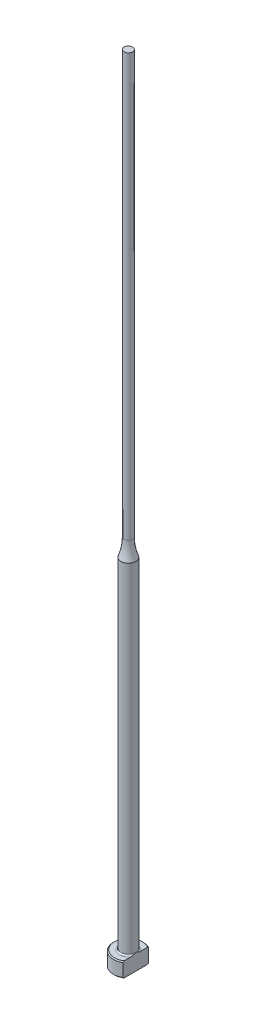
ISO-10303-21;
HEADER;
FILE_DESCRIPTION(('STEP AP214'),'2;1');
FILE_NAME('part.step','',(''),(''),'','','');
FILE_SCHEMA(('AUTOMOTIVE_DESIGN { 1 0 10303 214 1 1 1 1 }'));
ENDSEC;
DATA;
#1=APPLICATION_CONTEXT('core data for automotive mechanical design processes');
#2=APPLICATION_PROTOCOL_DEFINITION('international standard','automotive_design',2000,#1);
#3=PRODUCT_CONTEXT('',#1,'mechanical');
#4=PRODUCT('Part','Part','',(#3));
#5=PRODUCT_RELATED_PRODUCT_CATEGORY('part','',(#4));
#6=PRODUCT_DEFINITION_FORMATION('','',#4);
#7=PRODUCT_DEFINITION_CONTEXT('part definition',#1,'design');
#8=PRODUCT_DEFINITION('design','',#6,#7);
#9=PRODUCT_DEFINITION_SHAPE('','',#8);
#10=(LENGTH_UNIT() NAMED_UNIT(*) SI_UNIT(.MILLI.,.METRE.));
#11=(NAMED_UNIT(*) PLANE_ANGLE_UNIT() SI_UNIT($,.RADIAN.));
#12=(NAMED_UNIT(*) SI_UNIT($,.STERADIAN.) SOLID_ANGLE_UNIT());
#13=UNCERTAINTY_MEASURE_WITH_UNIT(LENGTH_MEASURE(1.E-05),#10,'distance_accuracy_value','');
#14=(GEOMETRIC_REPRESENTATION_CONTEXT(3) GLOBAL_UNCERTAINTY_ASSIGNED_CONTEXT((#13)) GLOBAL_UNIT_ASSIGNED_CONTEXT((#10,
#11,#12)) REPRESENTATION_CONTEXT('',''));
#15=CARTESIAN_POINT('',(0.,0.,0.));
#16=DIRECTION('',(0.,0.,1.));
#17=DIRECTION('',(1.,0.,0.));
#18=AXIS2_PLACEMENT_3D('',#15,#16,#17);
#19=CARTESIAN_POINT('',(-2.99999999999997,3.,0.));
#20=DIRECTION('',(0.,1.,0.));
#21=DIRECTION('',(0.,0.,1.));
#22=AXIS2_PLACEMENT_3D('',#19,#20,#21);
#23=PLANE('',#22);
#24=CARTESIAN_POINT('',(0.,3.,0.));
#25=DIRECTION('',(0.,1.,0.));
#26=DIRECTION('',(0.,0.,1.));
#27=AXIS2_PLACEMENT_3D('',#24,#25,#26);
#28=CIRCLE('',#27,2.79999999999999);
#29=CARTESIAN_POINT('',(1.49999999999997,3.,-2.36431808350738));
#30=VERTEX_POINT('',#29);
#31=CARTESIAN_POINT('',(1.49999999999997,3.,2.36431808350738));
#32=VERTEX_POINT('',#31);
#33=EDGE_CURVE('E187',#30,#32,#28,.T.);
#34=ORIENTED_EDGE('',*,*,#33,.T.);
#35=DIRECTION('',(0.,0.,-1.));
#36=VECTOR('',#35,1.);
#37=CARTESIAN_POINT('',(1.49999999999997,3.,0.));
#38=LINE('',#37,#36);
#39=CARTESIAN_POINT('',(1.49999999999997,3.00000000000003,0.99498743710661));
#40=VERTEX_POINT('',#39);
#41=EDGE_CURVE('E57',#32,#40,#38,.T.);
#42=ORIENTED_EDGE('',*,*,#41,.T.);
#43=CARTESIAN_POINT('',(0.,3.,0.));
#44=DIRECTION('',(0.,1.,0.));
#45=DIRECTION('',(0.,0.,1.));
#46=AXIS2_PLACEMENT_3D('',#43,#44,#45);
#47=CIRCLE('',#46,1.79999999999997);
#48=CARTESIAN_POINT('',(1.49999999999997,3.00000000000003,-0.994987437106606));
#49=VERTEX_POINT('',#48);
#50=EDGE_CURVE('E108',#40,#49,#47,.F.);
#51=ORIENTED_EDGE('',*,*,#50,.T.);
#52=EDGE_CURVE('E137',#49,#30,#38,.T.);
#53=ORIENTED_EDGE('',*,*,#52,.T.);
#54=EDGE_LOOP('',(#34,#42,#51,#53));
#55=FACE_BOUND('',#54,.T.);
#56=ADVANCED_FACE('F32',(#55),#23,.T.);
#57=CARTESIAN_POINT('',(0.,259.958771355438,0.));
#58=DIRECTION('',(0.,1.,0.));
#59=DIRECTION('',(0.,0.,1.));
#60=AXIS2_PLACEMENT_3D('',#57,#58,#59);
#61=CYLINDRICAL_SURFACE('',#60,2.99999999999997);
#62=CARTESIAN_POINT('',(0.,2.80000000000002,0.));
#63=DIRECTION('',(0.,1.,0.));
#64=DIRECTION('',(0.,0.,1.));
#65=AXIS2_PLACEMENT_3D('',#62,#63,#64);
#66=CIRCLE('',#65,2.99999999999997);
#67=CARTESIAN_POINT('',(1.49999999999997,2.80000000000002,2.5980762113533));
#68=VERTEX_POINT('',#67);
#69=CARTESIAN_POINT('',(1.49999999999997,2.80000000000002,-2.5980762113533));
#70=VERTEX_POINT('',#69);
#71=EDGE_CURVE('E105',#68,#70,#66,.F.);
#72=ORIENTED_EDGE('',*,*,#71,.T.);
#73=DIRECTION('',(0.,-1.,0.));
#74=VECTOR('',#73,1.);
#75=CARTESIAN_POINT('',(1.49999999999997,160.,-2.5980762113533));
#76=LINE('',#75,#74);
#77=CARTESIAN_POINT('',(1.49999999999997,0.200000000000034,-2.5980762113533));
#78=VERTEX_POINT('',#77);
#79=EDGE_CURVE('E193',#70,#78,#76,.T.);
#80=ORIENTED_EDGE('',*,*,#79,.T.);
#81=CARTESIAN_POINT('',(0.,0.200000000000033,0.));
#82=DIRECTION('',(0.,-1.,0.));
#83=DIRECTION('',(0.,0.,-1.));
#84=AXIS2_PLACEMENT_3D('',#81,#82,#83);
#85=CIRCLE('',#84,2.99999999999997);
#86=CARTESIAN_POINT('',(1.49999999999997,0.200000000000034,2.5980762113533));
#87=VERTEX_POINT('',#86);
#88=EDGE_CURVE('E100',#78,#87,#85,.F.);
#89=ORIENTED_EDGE('',*,*,#88,.T.);
#90=DIRECTION('',(0.,-1.,0.));
#91=VECTOR('',#90,1.);
#92=CARTESIAN_POINT('',(1.49999999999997,160.,2.5980762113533));
#93=LINE('',#92,#91);
#94=EDGE_CURVE('E93',#68,#87,#93,.T.);
#95=ORIENTED_EDGE('',*,*,#94,.F.);
#96=EDGE_LOOP('',(#72,#80,#89,#95));
#97=FACE_BOUND('',#96,.T.);
#98=ADVANCED_FACE('F158',(#97),#61,.T.);
#99=CARTESIAN_POINT('',(0.,0.,0.));
#100=DIRECTION('',(0.,-1.,0.));
#101=DIRECTION('',(0.,0.,-1.));
#102=AXIS2_PLACEMENT_3D('',#99,#100,#101);
#103=PLANE('',#102);
#104=CARTESIAN_POINT('',(0.,0.,0.));
#105=DIRECTION('',(0.,-1.,0.));
#106=DIRECTION('',(0.,0.,-1.));
#107=AXIS2_PLACEMENT_3D('',#104,#105,#106);
#108=CIRCLE('',#107,2.79999999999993);
#109=CARTESIAN_POINT('',(1.49999999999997,0.,2.36431808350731));
#110=VERTEX_POINT('',#109);
#111=CARTESIAN_POINT('',(1.49999999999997,0.,-2.36431808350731));
#112=VERTEX_POINT('',#111);
#113=EDGE_CURVE('E98',#110,#112,#108,.T.);
#114=ORIENTED_EDGE('',*,*,#113,.T.);
#115=DIRECTION('',(0.,0.,1.));
#116=VECTOR('',#115,1.);
#117=CARTESIAN_POINT('',(1.49999999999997,0.,-2.5980762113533));
#118=LINE('',#117,#116);
#119=EDGE_CURVE('E83',#112,#110,#118,.T.);
#120=ORIENTED_EDGE('',*,*,#119,.T.);
#121=EDGE_LOOP('',(#114,#120));
#122=FACE_BOUND('',#121,.T.);
#123=ADVANCED_FACE('F103',(#122),#103,.T.);
#124=CARTESIAN_POINT('',(0.,3.,0.));
#125=DIRECTION('',(0.,-1.,0.));
#126=DIRECTION('',(0.,0.,-1.));
#127=AXIS2_PLACEMENT_3D('',#124,#125,#126);
#128=CONICAL_SURFACE('',#127,2.79999999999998,0.785398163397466);
#129=ORIENTED_EDGE('',*,*,#71,.F.);
#130=CARTESIAN_POINT('',(1.49999999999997,-0.111741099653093,5.71827621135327));
#131=CARTESIAN_POINT('',(1.49999999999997,0.0136183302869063,5.58866816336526));
#132=CARTESIAN_POINT('',(1.49999999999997,0.138843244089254,5.45892957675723));
#133=CARTESIAN_POINT('',(1.49999999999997,0.388944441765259,5.19911365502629));
#134=CARTESIAN_POINT('',(1.49999999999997,0.513820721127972,5.06903631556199));
#135=CARTESIAN_POINT('',(1.49999999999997,0.763205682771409,4.80840180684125));
#136=CARTESIAN_POINT('',(1.49999999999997,0.887714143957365,4.67784442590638));
#137=CARTESIAN_POINT('',(1.49999999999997,1.13618059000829,4.41620813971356));
#138=CARTESIAN_POINT('',(1.49999999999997,1.26013857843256,4.28512923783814));
#139=CARTESIAN_POINT('',(1.49999999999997,1.50488975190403,4.02490837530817));
#140=CARTESIAN_POINT('',(1.49999999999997,1.6256969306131,3.89577958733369));
#141=CARTESIAN_POINT('',(1.49999999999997,1.86640694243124,3.63668213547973));
#142=CARTESIAN_POINT('',(1.49999999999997,1.98630978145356,3.50671347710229));
#143=CARTESIAN_POINT('',(1.49999999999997,2.22486033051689,3.24567921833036));
#144=CARTESIAN_POINT('',(1.49999999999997,2.34350830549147,3.11461386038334));
#145=CARTESIAN_POINT('',(1.49999999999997,2.57907716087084,2.85094268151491));
#146=CARTESIAN_POINT('',(1.49999999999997,2.69599811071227,2.71833692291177));
#147=CARTESIAN_POINT('',(1.49999999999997,2.88262371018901,2.50255231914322));
#148=CARTESIAN_POINT('',(1.49999999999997,2.95312454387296,2.42006293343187));
#149=CARTESIAN_POINT('',(1.49999999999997,3.0928709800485,2.25401084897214));
#150=CARTESIAN_POINT('',(1.49999999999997,3.16211645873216,2.17044804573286));
#151=CARTESIAN_POINT('',(1.49999999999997,3.29964684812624,2.00105967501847));
#152=CARTESIAN_POINT('',(1.49999999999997,3.36791386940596,1.91521952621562));
#153=CARTESIAN_POINT('',(1.49999999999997,3.50205840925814,1.74171392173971));
#154=CARTESIAN_POINT('',(1.49999999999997,3.56793649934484,1.65404891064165));
#155=CARTESIAN_POINT('',(1.49999999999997,3.69728151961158,1.47490236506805));
#156=CARTESIAN_POINT('',(1.49999999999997,3.76069661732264,1.38338308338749));
#157=CARTESIAN_POINT('',(1.49999999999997,3.8823953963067,1.19675661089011));
#158=CARTESIAN_POINT('',(1.49999999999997,3.94067201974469,1.10164473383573));
#159=CARTESIAN_POINT('',(1.49999999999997,4.04841325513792,0.908008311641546));
#160=CARTESIAN_POINT('',(1.49999999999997,4.0979780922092,0.809540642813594));
#161=CARTESIAN_POINT('',(1.49999999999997,4.18432188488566,0.607192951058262));
#162=CARTESIAN_POINT('',(1.49999999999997,4.22114374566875,0.503332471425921));
#163=CARTESIAN_POINT('',(1.49999999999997,4.26099935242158,0.347577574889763));
#164=CARTESIAN_POINT('',(1.49999999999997,4.27157029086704,0.297609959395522));
#165=CARTESIAN_POINT('',(1.49999999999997,4.28794860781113,0.196885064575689));
#166=CARTESIAN_POINT('',(1.49999999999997,4.29375640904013,0.146127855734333));
#167=CARTESIAN_POINT('',(1.49999999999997,4.30019707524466,0.0444388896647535));
#168=CARTESIAN_POINT('',(1.49999999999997,4.30084594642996,-0.00649183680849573));
#169=CARTESIAN_POINT('',(1.49999999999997,4.29696416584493,-0.108155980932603));
#170=CARTESIAN_POINT('',(1.49999999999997,4.29243308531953,-0.15888938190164));
#171=CARTESIAN_POINT('',(1.49999999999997,4.27856915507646,-0.259234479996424));
#172=CARTESIAN_POINT('',(1.49999999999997,4.26927821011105,-0.30885208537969));
#173=CARTESIAN_POINT('',(1.49999999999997,4.24647108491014,-0.407110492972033));
#174=CARTESIAN_POINT('',(1.49999999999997,4.2329532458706,-0.455750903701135));
#175=CARTESIAN_POINT('',(1.49999999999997,4.20226175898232,-0.552149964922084));
#176=CARTESIAN_POINT('',(1.49999999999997,4.18506801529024,-0.599902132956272));
#177=CARTESIAN_POINT('',(1.49999999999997,4.14771387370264,-0.694205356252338));
#178=CARTESIAN_POINT('',(1.49999999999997,4.1275540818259,-0.740756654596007));
#179=CARTESIAN_POINT('',(1.49999999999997,4.06327696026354,-0.879166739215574));
#180=CARTESIAN_POINT('',(1.49999999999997,4.01551721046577,-0.969329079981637));
#181=CARTESIAN_POINT('',(1.49999999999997,3.91367909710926,-1.1460431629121));
#182=CARTESIAN_POINT('',(1.49999999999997,3.85959300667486,-1.23259031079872));
#183=CARTESIAN_POINT('',(1.49999999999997,3.74697968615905,-1.40321348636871));
#184=CARTESIAN_POINT('',(1.49999999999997,3.68843573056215,-1.48727838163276));
#185=CARTESIAN_POINT('',(1.49999999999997,3.56843845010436,-1.65322187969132));
#186=CARTESIAN_POINT('',(1.49999999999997,3.50698656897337,-1.73510153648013));
#187=CARTESIAN_POINT('',(1.49999999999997,3.38115673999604,-1.89829823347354));
#188=CARTESIAN_POINT('',(1.49999999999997,3.31675092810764,-1.97959369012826));
#189=CARTESIAN_POINT('',(1.49999999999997,3.18634068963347,-2.14090082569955));
#190=CARTESIAN_POINT('',(1.49999999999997,3.12033609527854,-2.22091236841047));
#191=CARTESIAN_POINT('',(1.49999999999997,2.92086431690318,-2.45906508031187));
#192=CARTESIAN_POINT('',(1.49999999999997,2.78562663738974,-2.61572090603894));
#193=CARTESIAN_POINT('',(1.49999999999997,2.53554498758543,-2.90006295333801));
#194=CARTESIAN_POINT('',(1.49999999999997,2.42114543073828,-3.02814382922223));
#195=CARTESIAN_POINT('',(1.49999999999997,2.19093557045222,-3.28303767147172));
#196=CARTESIAN_POINT('',(1.49999999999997,2.07512522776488,-3.40985060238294));
#197=CARTESIAN_POINT('',(1.49999999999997,1.72597067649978,-3.7891384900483));
#198=CARTESIAN_POINT('',(1.49999999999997,1.49111760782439,-4.04022177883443));
#199=CARTESIAN_POINT('',(1.49999999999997,1.02882478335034,-4.52992803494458));
#200=CARTESIAN_POINT('',(1.49999999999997,0.801477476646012,-4.76863870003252));
#201=CARTESIAN_POINT('',(1.49999999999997,0.459548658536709,-5.12558036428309));
#202=CARTESIAN_POINT('',(1.49999999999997,0.345484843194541,-5.2443077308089));
#203=CARTESIAN_POINT('',(1.49999999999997,0.117071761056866,-5.48148573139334));
#204=CARTESIAN_POINT('',(1.49999999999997,0.00272249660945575,-5.59993636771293));
#205=CARTESIAN_POINT('',(1.49999999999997,-0.111741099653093,-5.71827621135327));
#206=B_SPLINE_CURVE_WITH_KNOTS('',3,(#130,#131,#132,#133,#134,#135,#136,#137,#138,#139,#140,
#141,#142,#143,#144,#145,#146,#147,#148,#149,#150,#151,#152,#153,#154,#155,#156,#157,#158,#159,
#160,#161,#162,#163,#164,#165,#166,#167,#168,#169,#170,#171,#172,#173,#174,#175,#176,#177,#178,
#179,#180,#181,#182,#183,#184,#185,#186,#187,#188,#189,#190,#191,#192,#193,#194,#195,#196,#197,
#198,#199,#200,#201,#202,#203,#204,#205),.UNSPECIFIED.,.F.,.F.,(4,2,2,2,2,2,2,2,2,2,2,2,2,2,2,2,
2,2,2,2,2,2,2,2,2,2,2,2,2,2,2,2,2,2,2,2,2,4),(0.,0.540943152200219,1.08189327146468,
1.62312052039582,2.16434426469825,2.69482920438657,3.22531067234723,3.75567781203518,
4.2860235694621,4.61155053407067,4.93710943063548,5.2661094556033,5.59503024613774,
5.92894782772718,6.26331713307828,6.59354403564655,6.92264800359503,7.0756747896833,
7.22868799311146,7.38122626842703,7.53377717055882,7.68500755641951,7.83629736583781,
7.98843643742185,8.14054446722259,8.44618799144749,8.75220879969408,9.05944044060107,
9.36652111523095,9.67764287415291,9.98879742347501,10.6095925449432,11.1247803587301,
11.6399825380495,12.6713544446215,13.6603005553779,14.1542238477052,14.6481430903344),.UNSPECIFIED.);
#207=EDGE_CURVE('E136',#68,#32,#206,.T.);
#208=ORIENTED_EDGE('',*,*,#207,.T.);
#209=ORIENTED_EDGE('',*,*,#33,.F.);
#210=EDGE_CURVE('E128',#30,#70,#206,.T.);
#211=ORIENTED_EDGE('',*,*,#210,.T.);
#212=EDGE_LOOP('',(#129,#208,#209,#211));
#213=FACE_BOUND('',#212,.T.);
#214=ADVANCED_FACE('F144',(#213),#128,.T.);
#215=CARTESIAN_POINT('',(0.,0.200000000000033,0.));
#216=DIRECTION('',(0.,1.,0.));
#217=DIRECTION('',(0.,0.,1.));
#218=AXIS2_PLACEMENT_3D('',#215,#216,#217);
#219=CONICAL_SURFACE('',#218,2.99999999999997,0.785398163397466);
#220=ORIENTED_EDGE('',*,*,#88,.F.);
#221=CARTESIAN_POINT('',(1.49999999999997,3.11174109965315,-5.71827621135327));
#222=CARTESIAN_POINT('',(1.49999999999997,2.98638166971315,-5.58866816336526));
#223=CARTESIAN_POINT('',(1.49999999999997,2.8611567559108,-5.45892957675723));
#224=CARTESIAN_POINT('',(1.49999999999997,2.6110555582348,-5.19911365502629));
#225=CARTESIAN_POINT('',(1.49999999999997,2.48617927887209,-5.06903631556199));
#226=CARTESIAN_POINT('',(1.49999999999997,2.23679431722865,-4.80840180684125));
#227=CARTESIAN_POINT('',(1.49999999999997,2.11228585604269,-4.67784442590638));
#228=CARTESIAN_POINT('',(1.49999999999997,1.86381940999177,-4.41620813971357));
#229=CARTESIAN_POINT('',(1.49999999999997,1.7398614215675,-4.28512923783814));
#230=CARTESIAN_POINT('',(1.49999999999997,1.49511024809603,-4.02490837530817));
#231=CARTESIAN_POINT('',(1.49999999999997,1.37430306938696,-3.89577958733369));
#232=CARTESIAN_POINT('',(1.49999999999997,1.13359305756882,-3.63668213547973));
#233=CARTESIAN_POINT('',(1.49999999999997,1.0136902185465,-3.50671347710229));
#234=CARTESIAN_POINT('',(1.49999999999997,0.775139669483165,-3.24567921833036));
#235=CARTESIAN_POINT('',(1.49999999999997,0.656491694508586,-3.11461386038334));
#236=CARTESIAN_POINT('',(1.49999999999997,0.420922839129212,-2.85094268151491));
#237=CARTESIAN_POINT('',(1.49999999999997,0.304001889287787,-2.71833692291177));
#238=CARTESIAN_POINT('',(1.49999999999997,0.117376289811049,-2.50255231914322));
#239=CARTESIAN_POINT('',(1.49999999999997,0.0468754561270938,-2.42006293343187));
#240=CARTESIAN_POINT('',(1.49999999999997,-0.0928709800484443,-2.25401084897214));
#241=CARTESIAN_POINT('',(1.49999999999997,-0.162116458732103,-2.17044804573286));
#242=CARTESIAN_POINT('',(1.49999999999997,-0.299646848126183,-2.00105967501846));
#243=CARTESIAN_POINT('',(1.49999999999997,-0.367913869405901,-1.91521952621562));
#244=CARTESIAN_POINT('',(1.49999999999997,-0.502058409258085,-1.74171392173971));
#245=CARTESIAN_POINT('',(1.49999999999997,-0.567936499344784,-1.65404891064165));
#246=CARTESIAN_POINT('',(1.49999999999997,-0.697281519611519,-1.47490236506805));
#247=CARTESIAN_POINT('',(1.49999999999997,-0.760696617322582,-1.38338308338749));
#248=CARTESIAN_POINT('',(1.49999999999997,-0.882395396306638,-1.19675661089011));
#249=CARTESIAN_POINT('',(1.49999999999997,-0.940672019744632,-1.10164473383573));
#250=CARTESIAN_POINT('',(1.49999999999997,-1.04841325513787,-0.908008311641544));
#251=CARTESIAN_POINT('',(1.49999999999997,-1.09797809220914,-0.809540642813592));
#252=CARTESIAN_POINT('',(1.49999999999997,-1.1843218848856,-0.60719295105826));
#253=CARTESIAN_POINT('',(1.49999999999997,-1.22114374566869,-0.503332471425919));
#254=CARTESIAN_POINT('',(1.49999999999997,-1.26099935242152,-0.347577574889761));
#255=CARTESIAN_POINT('',(1.49999999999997,-1.27157029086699,-0.29760995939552));
#256=CARTESIAN_POINT('',(1.49999999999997,-1.28794860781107,-0.196885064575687));
#257=CARTESIAN_POINT('',(1.49999999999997,-1.29375640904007,-0.146127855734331));
#258=CARTESIAN_POINT('',(1.49999999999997,-1.30019707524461,-0.0444388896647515));
#259=CARTESIAN_POINT('',(1.49999999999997,-1.3008459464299,0.00649183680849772));
#260=CARTESIAN_POINT('',(1.49999999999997,-1.29696416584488,0.108155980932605));
#261=CARTESIAN_POINT('',(1.49999999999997,-1.29243308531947,0.158889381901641));
#262=CARTESIAN_POINT('',(1.49999999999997,-1.2785691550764,0.259234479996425));
#263=CARTESIAN_POINT('',(1.49999999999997,-1.26927821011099,0.308852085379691));
#264=CARTESIAN_POINT('',(1.49999999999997,-1.24647108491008,0.407110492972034));
#265=CARTESIAN_POINT('',(1.49999999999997,-1.23295324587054,0.455750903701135));
#266=CARTESIAN_POINT('',(1.49999999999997,-1.20226175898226,0.552149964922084));
#267=CARTESIAN_POINT('',(1.49999999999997,-1.18506801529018,0.599902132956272));
#268=CARTESIAN_POINT('',(1.49999999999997,-1.14771387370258,0.694205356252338));
#269=CARTESIAN_POINT('',(1.49999999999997,-1.12755408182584,0.740756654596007));
#270=CARTESIAN_POINT('',(1.49999999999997,-1.06327696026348,0.879166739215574));
#271=CARTESIAN_POINT('',(1.49999999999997,-1.01551721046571,0.969329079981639));
#272=CARTESIAN_POINT('',(1.49999999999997,-0.913679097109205,1.1460431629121));
#273=CARTESIAN_POINT('',(1.49999999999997,-0.8595930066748,1.23259031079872));
#274=CARTESIAN_POINT('',(1.49999999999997,-0.746979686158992,1.40321348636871));
#275=CARTESIAN_POINT('',(1.49999999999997,-0.688435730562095,1.48727838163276));
#276=CARTESIAN_POINT('',(1.49999999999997,-0.568438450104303,1.65322187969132));
#277=CARTESIAN_POINT('',(1.49999999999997,-0.506986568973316,1.73510153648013));
#278=CARTESIAN_POINT('',(1.49999999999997,-0.381156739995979,1.89829823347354));
#279=CARTESIAN_POINT('',(1.49999999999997,-0.316750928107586,1.97959369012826));
#280=CARTESIAN_POINT('',(1.49999999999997,-0.186340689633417,2.14090082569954));
#281=CARTESIAN_POINT('',(1.49999999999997,-0.120336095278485,2.22091236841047));
#282=CARTESIAN_POINT('',(1.49999999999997,0.0791356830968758,2.45906508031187));
#283=CARTESIAN_POINT('',(1.49999999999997,0.214373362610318,2.61572090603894));
#284=CARTESIAN_POINT('',(1.49999999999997,0.46445501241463,2.90006295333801));
#285=CARTESIAN_POINT('',(1.49999999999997,0.578854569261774,3.02814382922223));
#286=CARTESIAN_POINT('',(1.49999999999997,0.809064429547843,3.28303767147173));
#287=CARTESIAN_POINT('',(1.49999999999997,0.924874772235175,3.40985060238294));
#288=CARTESIAN_POINT('',(1.49999999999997,1.27402932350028,3.78913849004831));
#289=CARTESIAN_POINT('',(1.49999999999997,1.50888239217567,4.04022177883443));
#290=CARTESIAN_POINT('',(1.49999999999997,1.97117521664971,4.52992803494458));
#291=CARTESIAN_POINT('',(1.49999999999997,2.19852252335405,4.76863870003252));
#292=CARTESIAN_POINT('',(1.49999999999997,2.54045134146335,5.12558036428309));
#293=CARTESIAN_POINT('',(1.49999999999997,2.65451515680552,5.2443077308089));
#294=CARTESIAN_POINT('',(1.49999999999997,2.88292823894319,5.48148573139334));
#295=CARTESIAN_POINT('',(1.49999999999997,2.9972775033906,5.59993636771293));
#296=CARTESIAN_POINT('',(1.49999999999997,3.11174109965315,5.71827621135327));
#297=B_SPLINE_CURVE_WITH_KNOTS('',3,(#221,#222,#223,#224,#225,#226,#227,#228,#229,#230,#231,
#232,#233,#234,#235,#236,#237,#238,#239,#240,#241,#242,#243,#244,#245,#246,#247,#248,#249,#250,
#251,#252,#253,#254,#255,#256,#257,#258,#259,#260,#261,#262,#263,#264,#265,#266,#267,#268,#269,
#270,#271,#272,#273,#274,#275,#276,#277,#278,#279,#280,#281,#282,#283,#284,#285,#286,#287,#288,
#289,#290,#291,#292,#293,#294,#295,#296),.UNSPECIFIED.,.F.,.F.,(4,2,2,2,2,2,2,2,2,2,2,2,2,2,2,2,
2,2,2,2,2,2,2,2,2,2,2,2,2,2,2,2,2,2,2,2,2,4),(0.,0.540943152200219,1.08189327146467,
1.62312052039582,2.16434426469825,2.69482920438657,3.22531067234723,3.75567781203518,
4.28602356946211,4.61155053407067,4.93710943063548,5.2661094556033,5.59503024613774,
5.92894782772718,6.26331713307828,6.59354403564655,6.92264800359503,7.0756747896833,
7.22868799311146,7.38122626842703,7.53377717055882,7.68500755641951,7.83629736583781,
7.98843643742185,8.14054446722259,8.4461879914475,8.75220879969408,9.05944044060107,
9.36652111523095,9.6776428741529,9.98879742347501,10.6095925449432,11.1247803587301,
11.6399825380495,12.6713544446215,13.6603005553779,14.1542238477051,14.6481430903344),.UNSPECIFIED.);
#298=EDGE_CURVE('E86',#78,#112,#297,.T.);
#299=ORIENTED_EDGE('',*,*,#298,.T.);
#300=ORIENTED_EDGE('',*,*,#113,.F.);
#301=EDGE_CURVE('E89',#110,#87,#297,.T.);
#302=ORIENTED_EDGE('',*,*,#301,.T.);
#303=EDGE_LOOP('',(#220,#299,#300,#302));
#304=FACE_BOUND('',#303,.T.);
#305=ADVANCED_FACE('F97',(#304),#219,.T.);
#306=CARTESIAN_POINT('',(0.,3.30000000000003,0.));
#307=DIRECTION('',(0.,1.,0.));
#308=DIRECTION('',(0.,0.,1.));
#309=AXIS2_PLACEMENT_3D('',#306,#307,#308);
#310=TOROIDAL_SURFACE('',#309,1.79999999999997,0.3);
#311=CARTESIAN_POINT('',(1.49999999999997,3.30000000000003,0.));
#312=CARTESIAN_POINT('',(1.49999999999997,3.300000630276,3.41555678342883E-12));
#313=CARTESIAN_POINT('',(1.49999999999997,3.30000126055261,-1.15373640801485E-07));
#314=CARTESIAN_POINT('',(1.49999999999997,3.3000024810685,-4.90631575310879E-07));
#315=CARTESIAN_POINT('',(1.49999999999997,3.30000307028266,-7.53296670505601E-07));
#316=CARTESIAN_POINT('',(1.49999999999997,3.30000424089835,-1.38757096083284E-06));
#317=CARTESIAN_POINT('',(1.49999999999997,3.300004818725,-1.76563001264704E-06));
#318=CARTESIAN_POINT('',(1.49999999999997,3.30000591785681,-2.58768006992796E-06));
#319=CARTESIAN_POINT('',(1.49999999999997,3.30000643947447,-3.03127014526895E-06));
#320=CARTESIAN_POINT('',(1.49999999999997,3.30000815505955,-4.60021967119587E-06));
#321=CARTESIAN_POINT('',(1.49999999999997,3.30000927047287,-5.8124152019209E-06));
#322=CARTESIAN_POINT('',(1.49999999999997,3.30001128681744,-8.33989413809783E-06));
#323=CARTESIAN_POINT('',(1.49999999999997,3.30001219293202,-9.65128157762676E-06));
#324=CARTESIAN_POINT('',(1.49999999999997,3.30001551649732,-1.46782505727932E-05));
#325=CARTESIAN_POINT('',(1.49999999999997,3.30001775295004,-1.8517976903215E-05));
#326=CARTESIAN_POINT('',(1.49999999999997,3.30002148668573,-2.61616194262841E-05));
#327=CARTESIAN_POINT('',(1.49999999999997,3.30002302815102,-2.99447742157E-05));
#328=CARTESIAN_POINT('',(1.49999999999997,3.30002943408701,-4.58003743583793E-05));
#329=CARTESIAN_POINT('',(1.49999999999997,3.3000341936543,-5.79079078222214E-05));
#330=CARTESIAN_POINT('',(1.49999999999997,3.30004197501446,-8.07263755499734E-05));
#331=CARTESIAN_POINT('',(1.49999999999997,3.30004514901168,-9.13834709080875E-05));
#332=CARTESIAN_POINT('',(1.49999999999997,3.30006989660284,-0.000167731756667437));
#333=CARTESIAN_POINT('',(1.49999999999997,3.30010092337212,-0.000229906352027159));
#334=CARTESIAN_POINT('',(1.49999999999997,3.30021632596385,-0.000470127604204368));
#335=CARTESIAN_POINT('',(1.49999999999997,3.30029368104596,-0.000650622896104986));
#336=CARTESIAN_POINT('',(1.49999999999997,3.30059619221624,-0.00134589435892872));
#337=CARTESIAN_POINT('',(1.49999999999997,3.30082870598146,-0.00185814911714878));
#338=CARTESIAN_POINT('',(1.49999999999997,3.30176696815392,-0.00393547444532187));
#339=CARTESIAN_POINT('',(1.49999999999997,3.30246445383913,-0.00550332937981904));
#340=CARTESIAN_POINT('',(1.49999999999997,3.31426785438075,-0.0320229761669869));
#341=CARTESIAN_POINT('',(1.49999999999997,3.32544800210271,-0.0569503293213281));
#342=CARTESIAN_POINT('',(1.49999999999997,3.34725700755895,-0.105984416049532));
#343=CARTESIAN_POINT('',(1.49999999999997,3.35789134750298,-0.130088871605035));
#344=CARTESIAN_POINT('',(1.49999999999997,3.38015321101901,-0.181096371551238));
#345=CARTESIAN_POINT('',(1.49999999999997,3.39175804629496,-0.208009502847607));
#346=CARTESIAN_POINT('',(1.49999999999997,3.41469034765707,-0.262264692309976));
#347=CARTESIAN_POINT('',(1.49999999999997,3.42601398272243,-0.289608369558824));
#348=CARTESIAN_POINT('',(1.49999999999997,3.45363212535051,-0.35820378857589));
#349=CARTESIAN_POINT('',(1.49999999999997,3.46959026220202,-0.39959288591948));
#350=CARTESIAN_POINT('',(1.49999999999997,3.49940505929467,-0.482097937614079));
#351=CARTESIAN_POINT('',(1.49999999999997,3.51330033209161,-0.523199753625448));
#352=CARTESIAN_POINT('',(1.49999999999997,3.53552507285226,-0.595497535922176));
#353=CARTESIAN_POINT('',(1.49999999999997,3.54436834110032,-0.626532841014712));
#354=CARTESIAN_POINT('',(1.49999999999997,3.56052427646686,-0.6891760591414));
#355=CARTESIAN_POINT('',(1.49999999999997,3.5678279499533,-0.720786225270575));
#356=CARTESIAN_POINT('',(1.49999999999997,3.5875075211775,-0.819524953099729));
#357=CARTESIAN_POINT('',(1.49999999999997,3.59661044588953,-0.88742909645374));
#358=CARTESIAN_POINT('',(1.49999999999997,3.60059842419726,-0.991180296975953));
#359=CARTESIAN_POINT('',(1.49999999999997,3.60019840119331,-1.02684364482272));
#360=CARTESIAN_POINT('',(1.49999999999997,3.59497085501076,-1.097505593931));
#361=CARTESIAN_POINT('',(1.49999999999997,3.59019295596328,-1.13250716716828));
#362=CARTESIAN_POINT('',(1.49999999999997,3.57687734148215,-1.19353096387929));
#363=CARTESIAN_POINT('',(1.49999999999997,3.56943875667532,-1.21978854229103));
#364=CARTESIAN_POINT('',(1.49999999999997,3.55063748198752,-1.27094658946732));
#365=CARTESIAN_POINT('',(1.49999999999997,3.53927342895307,-1.29584658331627));
#366=CARTESIAN_POINT('',(1.49999999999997,3.51660016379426,-1.33501873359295));
#367=CARTESIAN_POINT('',(1.49999999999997,3.50657738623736,-1.35003296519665));
#368=CARTESIAN_POINT('',(1.49999999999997,3.48437469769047,-1.37837252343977));
#369=CARTESIAN_POINT('',(1.49999999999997,3.47219867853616,-1.39170082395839));
#370=CARTESIAN_POINT('',(1.49999999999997,3.44835614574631,-1.41349417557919));
#371=CARTESIAN_POINT('',(1.49999999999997,3.43709185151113,-1.42239673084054));
#372=CARTESIAN_POINT('',(1.49999999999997,3.41325256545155,-1.43825467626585));
#373=CARTESIAN_POINT('',(1.49999999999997,3.40067804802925,-1.44521076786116));
#374=CARTESIAN_POINT('',(1.49999999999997,3.37433767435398,-1.45677158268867));
#375=CARTESIAN_POINT('',(1.49999999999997,3.36056203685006,-1.46135438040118));
#376=CARTESIAN_POINT('',(1.49999999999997,3.33237324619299,-1.46767730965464));
#377=CARTESIAN_POINT('',(1.49999999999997,3.31796076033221,-1.46942034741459));
#378=CARTESIAN_POINT('',(1.49999999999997,3.29122479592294,-1.4698720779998));
#379=CARTESIAN_POINT('',(1.49999999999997,3.27890664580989,-1.468990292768));
#380=CARTESIAN_POINT('',(1.49999999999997,3.25461019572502,-1.4651157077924));
#381=CARTESIAN_POINT('',(1.49999999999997,3.2426318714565,-1.46212305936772));
#382=CARTESIAN_POINT('',(1.49999999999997,3.21959683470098,-1.4543117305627));
#383=CARTESIAN_POINT('',(1.49999999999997,3.20852542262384,-1.44953579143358));
#384=CARTESIAN_POINT('',(1.49999999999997,3.18721125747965,-1.43840957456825));
#385=CARTESIAN_POINT('',(1.49999999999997,3.1769687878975,-1.43205876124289));
#386=CARTESIAN_POINT('',(1.49999999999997,3.15325976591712,-1.41506353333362));
#387=CARTESIAN_POINT('',(1.49999999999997,3.14027750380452,-1.40374235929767));
#388=CARTESIAN_POINT('',(1.49999999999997,3.11630720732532,-1.37914825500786));
#389=CARTESIAN_POINT('',(1.49999999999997,3.10532420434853,-1.36587054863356));
#390=CARTESIAN_POINT('',(1.49999999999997,3.08100891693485,-1.33197272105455));
#391=CARTESIAN_POINT('',(1.49999999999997,3.06867625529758,-1.31063843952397));
#392=CARTESIAN_POINT('',(1.49999999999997,3.04751867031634,-1.26637455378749));
#393=CARTESIAN_POINT('',(1.49999999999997,3.03869240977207,-1.24344556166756));
#394=CARTESIAN_POINT('',(1.49999999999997,3.01978360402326,-1.18316534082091));
#395=CARTESIAN_POINT('',(1.49999999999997,3.01191472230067,-1.14512623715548));
#396=CARTESIAN_POINT('',(1.49999999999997,3.00188285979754,-1.06789971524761));
#397=CARTESIAN_POINT('',(1.49999999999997,2.99979735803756,-1.02870374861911));
#398=CARTESIAN_POINT('',(1.49999999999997,3.00021727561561,-0.953160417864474));
#399=CARTESIAN_POINT('',(1.49999999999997,3.00240673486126,-0.916808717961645));
#400=CARTESIAN_POINT('',(1.49999999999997,3.0099643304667,-0.844432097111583));
#401=CARTESIAN_POINT('',(1.49999999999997,3.01533462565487,-0.808407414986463));
#402=CARTESIAN_POINT('',(1.49999999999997,3.02828086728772,-0.738670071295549));
#403=CARTESIAN_POINT('',(1.49999999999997,3.03573028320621,-0.704933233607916));
#404=CARTESIAN_POINT('',(1.49999999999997,3.05243174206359,-0.638128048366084));
#405=CARTESIAN_POINT('',(1.49999999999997,3.06167285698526,-0.605056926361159));
#406=CARTESIAN_POINT('',(1.49999999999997,3.08440652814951,-0.53019513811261));
#407=CARTESIAN_POINT('',(1.49999999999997,3.09836576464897,-0.488547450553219));
#408=CARTESIAN_POINT('',(1.49999999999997,3.1283820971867,-0.404954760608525));
#409=CARTESIAN_POINT('',(1.49999999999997,3.14447968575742,-0.363024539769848));
#410=CARTESIAN_POINT('',(1.49999999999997,3.17238454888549,-0.293508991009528));
#411=CARTESIAN_POINT('',(1.49999999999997,3.18384249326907,-0.265781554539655));
#412=CARTESIAN_POINT('',(1.49999999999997,3.20705854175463,-0.210769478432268));
#413=CARTESIAN_POINT('',(1.49999999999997,3.21881265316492,-0.183483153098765));
#414=CARTESIAN_POINT('',(1.49999999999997,3.24136702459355,-0.131772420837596));
#415=CARTESIAN_POINT('',(1.49999999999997,3.25214361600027,-0.107337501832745));
#416=CARTESIAN_POINT('',(1.49999999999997,3.27424746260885,-0.0576321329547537));
#417=CARTESIAN_POINT('',(1.49999999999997,3.28558038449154,-0.0323640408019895));
#418=CARTESIAN_POINT('',(1.49999999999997,3.29753556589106,-0.00550327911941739));
#419=CARTESIAN_POINT('',(1.49999999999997,3.29823307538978,-0.00393537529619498));
#420=CARTESIAN_POINT('',(1.49999999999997,3.29917134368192,-0.00185803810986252));
#421=CARTESIAN_POINT('',(1.49999999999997,3.29940384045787,-0.00134582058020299));
#422=CARTESIAN_POINT('',(1.49999999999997,3.29970633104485,-0.000650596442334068));
#423=CARTESIAN_POINT('',(1.49999999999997,3.29978368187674,-0.000470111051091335));
#424=CARTESIAN_POINT('',(1.49999999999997,3.29989907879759,-0.000229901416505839));
#425=CARTESIAN_POINT('',(1.49999999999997,3.29993010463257,-0.000167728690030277));
#426=CARTESIAN_POINT('',(1.49999999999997,3.29995485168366,-9.13825689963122E-05));
#427=CARTESIAN_POINT('',(1.49999999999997,3.29995802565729,-8.07256241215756E-05));
#428=CARTESIAN_POINT('',(1.49999999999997,3.29996580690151,-5.79074820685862E-05));
#429=CARTESIAN_POINT('',(1.49999999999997,3.29997056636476,-4.5800119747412E-05));
#430=CARTESIAN_POINT('',(1.49999999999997,3.29997697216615,-2.99447119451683E-05));
#431=CARTESIAN_POINT('',(1.49999999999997,3.2999785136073,-2.61615817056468E-05));
#432=CARTESIAN_POINT('',(1.49999999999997,3.2999822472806,-1.85179845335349E-05));
#433=CARTESIAN_POINT('',(1.49999999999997,3.29998448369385,-1.46782782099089E-05));
#434=CARTESIAN_POINT('',(1.49999999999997,3.2999878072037,-9.65132752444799E-06));
#435=CARTESIAN_POINT('',(1.49999999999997,3.299988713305,-8.33994202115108E-06));
#436=CARTESIAN_POINT('',(1.49999999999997,3.29999072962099,-5.81246426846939E-06));
#437=CARTESIAN_POINT('',(1.49999999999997,3.29999184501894,-4.600267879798E-06));
#438=CARTESIAN_POINT('',(1.49999999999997,3.29999356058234,-3.03131394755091E-06));
#439=CARTESIAN_POINT('',(1.49999999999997,3.29999408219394,-2.58772196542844E-06));
#440=CARTESIAN_POINT('',(1.49999999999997,3.2999951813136,-1.76566701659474E-06));
#441=CARTESIAN_POINT('',(1.49999999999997,3.29999575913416,-1.38760497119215E-06));
#442=CARTESIAN_POINT('',(1.49999999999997,3.29999692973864,-7.53323425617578E-07));
#443=CARTESIAN_POINT('',(1.49999999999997,3.29999751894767,-4.90654189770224E-07));
#444=CARTESIAN_POINT('',(1.49999999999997,3.29999873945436,-1.15386267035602E-07));
#445=CARTESIAN_POINT('',(1.49999999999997,3.29999936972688,-3.41554144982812E-12));
#446=CARTESIAN_POINT('',(1.49999999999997,3.30000000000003,0.));
#447=B_SPLINE_CURVE_WITH_KNOTS('',3,(#311,#312,#313,#314,#315,#316,#317,#318,#319,#320,#321,
#322,#323,#324,#325,#326,#327,#328,#329,#330,#331,#332,#333,#334,#335,#336,#337,#338,#339,#340,
#341,#342,#343,#344,#345,#346,#347,#348,#349,#350,#351,#352,#353,#354,#355,#356,#357,#358,#359,
#360,#361,#362,#363,#364,#365,#366,#367,#368,#369,#370,#371,#372,#373,#374,#375,#376,#377,#378,
#379,#380,#381,#382,#383,#384,#385,#386,#387,#388,#389,#390,#391,#392,#393,#394,#395,#396,#397,
#398,#399,#400,#401,#402,#403,#404,#405,#406,#407,#408,#409,#410,#411,#412,#413,#414,#415,#416,
#417,#418,#419,#420,#421,#422,#423,#424,#425,#426,#427,#428,#429,#430,#431,#432,#433,#434,#435,
#436,#437,#438,#439,#440,#441,#442,#443,#444,#445,#446),.UNSPECIFIED.,.T.,.F.,(4,2,2,2,2,2,2,2,
2,2,2,2,2,2,2,2,2,2,2,2,2,2,2,2,2,2,2,2,2,2,2,2,2,2,2,2,2,2,2,2,2,2,2,2,2,2,2,2,2,2,2,2,2,2,2,2,
2,2,2,2,2,2,2,2,2,2,2,4),(0.,1.88906036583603E-06,3.8150959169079E-06,5.87892837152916E-06,
7.93062024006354E-06,1.28480890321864E-05,1.76261717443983E-05,3.0909918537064E-05,
4.31529750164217E-05,8.21699329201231E-05,0.000115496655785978,0.000323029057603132,
0.000912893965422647,0.00259963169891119,0.00774858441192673,0.0896975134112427,
0.168737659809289,0.256660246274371,0.345444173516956,0.478492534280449,0.608603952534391,
0.705372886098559,0.802692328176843,1.00719557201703,1.11399616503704,1.21960092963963,
1.30124317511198,1.38291380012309,1.43690814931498,1.49080588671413,1.53371524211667,
1.57660911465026,1.61989249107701,1.66313154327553,1.69999492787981,1.73685567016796,
1.77288440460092,1.80892540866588,1.86031324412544,1.91182866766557,1.98534297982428,
2.05882922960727,2.1747172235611,2.29215041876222,2.40123170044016,2.51038710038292,
2.613972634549,2.71694519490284,2.84866234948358,2.98337525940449,3.07337666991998,
3.16250453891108,3.24262397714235,3.32569301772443,3.3308421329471,3.33252874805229,
3.33311858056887,3.33332610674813,3.33335943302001,3.33339844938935,3.3334106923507,
3.33342397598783,3.33342875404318,3.33343367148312,3.33343572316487,3.33343778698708,
3.33343971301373,3.33344160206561),.UNSPECIFIED.);
#448=CARTESIAN_POINT('',(1.49999999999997,3.30000000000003,0.));
#449=VERTEX_POINT('',#448);
#450=EDGE_CURVE('E11',#49,#449,#447,.T.);
#451=ORIENTED_EDGE('',*,*,#450,.F.);
#452=ORIENTED_EDGE('',*,*,#50,.F.);
#453=CARTESIAN_POINT('',(1.49999999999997,3.30000000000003,0.));
#454=CARTESIAN_POINT('',(1.49999999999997,3.29999936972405,-3.41547770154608E-12));
#455=CARTESIAN_POINT('',(1.49999999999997,3.29999873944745,1.15373640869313E-07));
#456=CARTESIAN_POINT('',(1.49999999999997,3.29999751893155,4.90631575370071E-07));
#457=CARTESIAN_POINT('',(1.49999999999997,3.29999692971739,7.53296670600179E-07));
#458=CARTESIAN_POINT('',(1.49999999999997,3.2999957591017,1.38757096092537E-06));
#459=CARTESIAN_POINT('',(1.49999999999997,3.29999518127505,1.76563001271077E-06));
#460=CARTESIAN_POINT('',(1.49999999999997,3.29999408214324,2.58768007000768E-06));
#461=CARTESIAN_POINT('',(1.49999999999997,3.29999356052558,3.03127014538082E-06));
#462=CARTESIAN_POINT('',(1.49999999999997,3.2999918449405,4.60021967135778E-06));
#463=CARTESIAN_POINT('',(1.49999999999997,3.29999072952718,5.81241520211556E-06));
#464=CARTESIAN_POINT('',(1.49999999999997,3.29998871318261,8.33989413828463E-06));
#465=CARTESIAN_POINT('',(1.49999999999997,3.29998780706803,9.65128157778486E-06));
#466=CARTESIAN_POINT('',(1.49999999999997,3.29998448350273,1.46782505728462E-05));
#467=CARTESIAN_POINT('',(1.49999999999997,3.29998224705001,1.85179769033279E-05));
#468=CARTESIAN_POINT('',(1.49999999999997,3.29997851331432,2.61616194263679E-05));
#469=CARTESIAN_POINT('',(1.49999999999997,3.29997697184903,2.99447742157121E-05));
#470=CARTESIAN_POINT('',(1.49999999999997,3.29997056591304,4.58003743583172E-05));
#471=CARTESIAN_POINT('',(1.49999999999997,3.29996580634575,5.79079078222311E-05));
#472=CARTESIAN_POINT('',(1.49999999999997,3.29995802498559,8.07263755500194E-05));
#473=CARTESIAN_POINT('',(1.49999999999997,3.29995485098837,9.1383470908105E-05));
#474=CARTESIAN_POINT('',(1.49999999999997,3.29993010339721,0.000167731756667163));
#475=CARTESIAN_POINT('',(1.49999999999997,3.29989907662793,0.000229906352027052));
#476=CARTESIAN_POINT('',(1.49999999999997,3.2997836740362,0.000470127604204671));
#477=CARTESIAN_POINT('',(1.49999999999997,3.2997063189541,0.000650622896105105));
#478=CARTESIAN_POINT('',(1.49999999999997,3.29940380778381,0.00134589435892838));
#479=CARTESIAN_POINT('',(1.49999999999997,3.29917129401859,0.00185814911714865));
#480=CARTESIAN_POINT('',(1.49999999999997,3.29823303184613,0.00393547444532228));
#481=CARTESIAN_POINT('',(1.49999999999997,3.29753554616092,0.00550332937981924));
#482=CARTESIAN_POINT('',(1.49999999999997,3.2857321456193,0.0320229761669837));
#483=CARTESIAN_POINT('',(1.49999999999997,3.27455199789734,0.0569503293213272));
#484=CARTESIAN_POINT('',(1.49999999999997,3.2527429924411,0.105984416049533));
#485=CARTESIAN_POINT('',(1.49999999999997,3.24210865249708,0.130088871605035));
#486=CARTESIAN_POINT('',(1.49999999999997,3.21984678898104,0.181096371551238));
#487=CARTESIAN_POINT('',(1.49999999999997,3.20824195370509,0.208009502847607));
#488=CARTESIAN_POINT('',(1.49999999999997,3.18530965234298,0.262264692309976));
#489=CARTESIAN_POINT('',(1.49999999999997,3.17398601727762,0.289608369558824));
#490=CARTESIAN_POINT('',(1.49999999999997,3.14636787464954,0.35820378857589));
#491=CARTESIAN_POINT('',(1.49999999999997,3.13040973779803,0.39959288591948));
#492=CARTESIAN_POINT('',(1.49999999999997,3.10059494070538,0.482097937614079));
#493=CARTESIAN_POINT('',(1.49999999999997,3.08669966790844,0.523199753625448));
#494=CARTESIAN_POINT('',(1.49999999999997,3.06447492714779,0.595497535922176));
#495=CARTESIAN_POINT('',(1.49999999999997,3.05563165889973,0.626532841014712));
#496=CARTESIAN_POINT('',(1.49999999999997,3.03947572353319,0.6891760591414));
#497=CARTESIAN_POINT('',(1.49999999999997,3.03217205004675,0.720786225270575));
#498=CARTESIAN_POINT('',(1.49999999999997,3.01249247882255,0.819524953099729));
#499=CARTESIAN_POINT('',(1.49999999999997,3.00338955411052,0.88742909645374));
#500=CARTESIAN_POINT('',(1.49999999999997,2.99940157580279,0.991180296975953));
#501=CARTESIAN_POINT('',(1.49999999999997,2.99980159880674,1.02684364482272));
#502=CARTESIAN_POINT('',(1.49999999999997,3.00502914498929,1.097505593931));
#503=CARTESIAN_POINT('',(1.49999999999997,3.00980704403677,1.13250716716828));
#504=CARTESIAN_POINT('',(1.49999999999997,3.0231226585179,1.19353096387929));
#505=CARTESIAN_POINT('',(1.49999999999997,3.03056124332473,1.21978854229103));
#506=CARTESIAN_POINT('',(1.49999999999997,3.04936251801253,1.27094658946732));
#507=CARTESIAN_POINT('',(1.49999999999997,3.06072657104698,1.29584658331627));
#508=CARTESIAN_POINT('',(1.49999999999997,3.08339983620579,1.33501873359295));
#509=CARTESIAN_POINT('',(1.49999999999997,3.09342261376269,1.35003296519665));
#510=CARTESIAN_POINT('',(1.49999999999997,3.11562530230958,1.37837252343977));
#511=CARTESIAN_POINT('',(1.49999999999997,3.12780132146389,1.39170082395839));
#512=CARTESIAN_POINT('',(1.49999999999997,3.15164385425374,1.41349417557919));
#513=CARTESIAN_POINT('',(1.49999999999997,3.16290814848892,1.42239673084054));
#514=CARTESIAN_POINT('',(1.49999999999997,3.1867474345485,1.43825467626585));
#515=CARTESIAN_POINT('',(1.49999999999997,3.1993219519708,1.44521076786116));
#516=CARTESIAN_POINT('',(1.49999999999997,3.22566232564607,1.45677158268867));
#517=CARTESIAN_POINT('',(1.49999999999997,3.23943796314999,1.46135438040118));
#518=CARTESIAN_POINT('',(1.49999999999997,3.26762675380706,1.46767730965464));
#519=CARTESIAN_POINT('',(1.49999999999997,3.28203923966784,1.46942034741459));
#520=CARTESIAN_POINT('',(1.49999999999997,3.30877520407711,1.4698720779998));
#521=CARTESIAN_POINT('',(1.49999999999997,3.32109335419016,1.468990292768));
#522=CARTESIAN_POINT('',(1.49999999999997,3.34538980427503,1.4651157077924));
#523=CARTESIAN_POINT('',(1.49999999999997,3.35736812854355,1.46212305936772));
#524=CARTESIAN_POINT('',(1.49999999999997,3.38040316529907,1.4543117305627));
#525=CARTESIAN_POINT('',(1.49999999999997,3.39147457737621,1.44953579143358));
#526=CARTESIAN_POINT('',(1.49999999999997,3.4127887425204,1.43840957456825));
#527=CARTESIAN_POINT('',(1.49999999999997,3.42303121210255,1.43205876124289));
#528=CARTESIAN_POINT('',(1.49999999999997,3.44674023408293,1.41506353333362));
#529=CARTESIAN_POINT('',(1.49999999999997,3.45972249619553,1.40374235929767));
#530=CARTESIAN_POINT('',(1.49999999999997,3.48369279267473,1.37914825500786));
#531=CARTESIAN_POINT('',(1.49999999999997,3.49467579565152,1.36587054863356));
#532=CARTESIAN_POINT('',(1.49999999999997,3.5189910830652,1.33197272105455));
#533=CARTESIAN_POINT('',(1.49999999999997,3.53132374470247,1.31063843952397));
#534=CARTESIAN_POINT('',(1.49999999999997,3.55248132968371,1.26637455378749));
#535=CARTESIAN_POINT('',(1.49999999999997,3.56130759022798,1.24344556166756));
#536=CARTESIAN_POINT('',(1.49999999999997,3.58021639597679,1.18316534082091));
#537=CARTESIAN_POINT('',(1.49999999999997,3.58808527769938,1.14512623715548));
#538=CARTESIAN_POINT('',(1.49999999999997,3.59811714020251,1.06789971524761));
#539=CARTESIAN_POINT('',(1.49999999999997,3.60020264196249,1.02870374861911));
#540=CARTESIAN_POINT('',(1.49999999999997,3.59978272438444,0.953160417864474));
#541=CARTESIAN_POINT('',(1.49999999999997,3.59759326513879,0.916808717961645));
#542=CARTESIAN_POINT('',(1.49999999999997,3.59003566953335,0.844432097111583));
#543=CARTESIAN_POINT('',(1.49999999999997,3.58466537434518,0.808407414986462));
#544=CARTESIAN_POINT('',(1.49999999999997,3.57171913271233,0.738670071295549));
#545=CARTESIAN_POINT('',(1.49999999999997,3.56426971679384,0.704933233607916));
#546=CARTESIAN_POINT('',(1.49999999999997,3.54756825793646,0.638128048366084));
#547=CARTESIAN_POINT('',(1.49999999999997,3.53832714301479,0.605056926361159));
#548=CARTESIAN_POINT('',(1.49999999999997,3.51559347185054,0.53019513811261));
#549=CARTESIAN_POINT('',(1.49999999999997,3.50163423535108,0.488547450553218));
#550=CARTESIAN_POINT('',(1.49999999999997,3.47161790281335,0.404954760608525));
#551=CARTESIAN_POINT('',(1.49999999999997,3.45552031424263,0.363024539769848));
#552=CARTESIAN_POINT('',(1.49999999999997,3.42761545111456,0.293508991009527));
#553=CARTESIAN_POINT('',(1.49999999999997,3.41615750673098,0.265781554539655));
#554=CARTESIAN_POINT('',(1.49999999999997,3.39294145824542,0.210769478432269));
#555=CARTESIAN_POINT('',(1.49999999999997,3.38118734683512,0.183483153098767));
#556=CARTESIAN_POINT('',(1.49999999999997,3.3586329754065,0.131772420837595));
#557=CARTESIAN_POINT('',(1.49999999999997,3.3478563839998,0.10733750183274));
#558=CARTESIAN_POINT('',(1.49999999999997,3.32575253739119,0.0576321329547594));
#559=CARTESIAN_POINT('',(1.49999999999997,3.31441961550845,0.0323640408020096));
#560=CARTESIAN_POINT('',(1.49999999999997,3.30246443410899,0.00550327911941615));
#561=CARTESIAN_POINT('',(1.49999999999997,3.30176692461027,0.00393537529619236));
#562=CARTESIAN_POINT('',(1.49999999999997,3.30082865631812,0.00185803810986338));
#563=CARTESIAN_POINT('',(1.49999999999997,3.30059615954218,0.00134582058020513));
#564=CARTESIAN_POINT('',(1.49999999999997,3.3002936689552,0.000650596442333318));
#565=CARTESIAN_POINT('',(1.49999999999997,3.30021631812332,0.000470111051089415));
#566=CARTESIAN_POINT('',(1.49999999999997,3.30010092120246,0.000229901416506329));
#567=CARTESIAN_POINT('',(1.49999999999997,3.30006989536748,0.000167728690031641));
#568=CARTESIAN_POINT('',(1.49999999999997,3.30004514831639,9.13825689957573E-05));
#569=CARTESIAN_POINT('',(1.49999999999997,3.30004197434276,8.07256241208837E-05));
#570=CARTESIAN_POINT('',(1.49999999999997,3.30003419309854,5.79074820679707E-05));
#571=CARTESIAN_POINT('',(1.49999999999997,3.30002943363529,4.58001197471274E-05));
#572=CARTESIAN_POINT('',(1.49999999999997,3.3000230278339,2.99447119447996E-05));
#573=CARTESIAN_POINT('',(1.49999999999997,3.30002148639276,2.61615817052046E-05));
#574=CARTESIAN_POINT('',(1.49999999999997,3.30001775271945,1.85179845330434E-05));
#575=CARTESIAN_POINT('',(1.49999999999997,3.3000155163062,1.46782782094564E-05));
#576=CARTESIAN_POINT('',(1.49999999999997,3.30001219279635,9.65132752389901E-06));
#577=CARTESIAN_POINT('',(1.49999999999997,3.30001128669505,8.33994202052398E-06));
#578=CARTESIAN_POINT('',(1.49999999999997,3.30000927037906,5.8124642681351E-06));
#579=CARTESIAN_POINT('',(1.49999999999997,3.30000815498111,4.60026787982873E-06));
#580=CARTESIAN_POINT('',(1.49999999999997,3.30000643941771,3.03131394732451E-06));
#581=CARTESIAN_POINT('',(1.49999999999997,3.30000591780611,2.58772196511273E-06));
#582=CARTESIAN_POINT('',(1.49999999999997,3.30000481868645,1.76566701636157E-06));
#583=CARTESIAN_POINT('',(1.49999999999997,3.30000424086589,1.38760497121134E-06));
#584=CARTESIAN_POINT('',(1.49999999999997,3.3000030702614,7.53323425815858E-07));
#585=CARTESIAN_POINT('',(1.49999999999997,3.30000248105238,4.90654189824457E-07));
#586=CARTESIAN_POINT('',(1.49999999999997,3.30000126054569,1.15386266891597E-07));
#587=CARTESIAN_POINT('',(1.49999999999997,3.30000063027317,3.41546236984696E-12));
#588=CARTESIAN_POINT('',(1.49999999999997,3.30000000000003,0.));
#589=B_SPLINE_CURVE_WITH_KNOTS('',3,(#453,#454,#455,#456,#457,#458,#459,#460,#461,#462,#463,
#464,#465,#466,#467,#468,#469,#470,#471,#472,#473,#474,#475,#476,#477,#478,#479,#480,#481,#482,
#483,#484,#485,#486,#487,#488,#489,#490,#491,#492,#493,#494,#495,#496,#497,#498,#499,#500,#501,
#502,#503,#504,#505,#506,#507,#508,#509,#510,#511,#512,#513,#514,#515,#516,#517,#518,#519,#520,
#521,#522,#523,#524,#525,#526,#527,#528,#529,#530,#531,#532,#533,#534,#535,#536,#537,#538,#539,
#540,#541,#542,#543,#544,#545,#546,#547,#548,#549,#550,#551,#552,#553,#554,#555,#556,#557,#558,
#559,#560,#561,#562,#563,#564,#565,#566,#567,#568,#569,#570,#571,#572,#573,#574,#575,#576,#577,
#578,#579,#580,#581,#582,#583,#584,#585,#586,#587,#588),.UNSPECIFIED.,.T.,.F.,(4,2,2,2,2,2,2,2,
2,2,2,2,2,2,2,2,2,2,2,2,2,2,2,2,2,2,2,2,2,2,2,2,2,2,2,2,2,2,2,2,2,2,2,2,2,2,2,2,2,2,2,2,2,2,2,2,
2,2,2,2,2,2,2,2,2,2,2,4),(0.,1.88906036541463E-06,3.81509591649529E-06,5.87892837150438E-06,
7.93062024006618E-06,1.28480890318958E-05,1.76261717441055E-05,3.09099185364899E-05,
4.3152975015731E-05,8.21699329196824E-05,0.000115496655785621,0.000323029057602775,
0.000912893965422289,0.00259963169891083,0.00774858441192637,0.0896975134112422,
0.168737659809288,0.256660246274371,0.345444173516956,0.478492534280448,0.60860395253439,
0.705372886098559,0.802692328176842,1.00719557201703,1.11399616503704,1.21960092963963,
1.30124317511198,1.38291380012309,1.43690814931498,1.49080588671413,1.53371524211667,
1.57660911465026,1.61989249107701,1.66313154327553,1.69999492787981,1.73685567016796,
1.77288440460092,1.80892540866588,1.86031324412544,1.91182866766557,1.98534297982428,
2.05882922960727,2.1747172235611,2.29215041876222,2.40123170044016,2.51038710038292,
2.613972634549,2.71694519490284,2.84866234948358,2.98337525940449,3.07337666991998,
3.16250453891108,3.24262397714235,3.32569301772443,3.3308421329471,3.33252874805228,
3.33311858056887,3.33332610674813,3.33335943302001,3.33339844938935,3.3334106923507,
3.33342397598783,3.33342875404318,3.33343367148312,3.33343572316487,3.33343778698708,
3.33343971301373,3.33344160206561),.UNSPECIFIED.);
#590=EDGE_CURVE('E46',#449,#40,#589,.T.);
#591=ORIENTED_EDGE('',*,*,#590,.F.);
#592=CARTESIAN_POINT('',(0.,3.30000000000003,0.));
#593=DIRECTION('',(0.,1.,0.));
#594=DIRECTION('',(0.,0.,1.));
#595=AXIS2_PLACEMENT_3D('',#592,#593,#594);
#596=CIRCLE('',#595,1.49999999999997);
#597=EDGE_CURVE('E104',#449,#449,#596,.T.);
#598=ORIENTED_EDGE('',*,*,#597,.F.);
#599=EDGE_LOOP('',(#451,#452,#591,#598));
#600=FACE_BOUND('',#599,.T.);
#601=ADVANCED_FACE('F34',(#600),#310,.F.);
#602=CARTESIAN_POINT('',(-0.849999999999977,160.,0.));
#603=DIRECTION('',(0.,1.,0.));
#604=DIRECTION('',(0.,0.,1.));
#605=AXIS2_PLACEMENT_3D('',#602,#603,#604);
#606=PLANE('',#605);
#607=CARTESIAN_POINT('',(0.,160.,0.));
#608=DIRECTION('',(0.,1.,0.));
#609=DIRECTION('',(0.,0.,1.));
#610=AXIS2_PLACEMENT_3D('',#607,#608,#609);
#611=CIRCLE('',#610,0.849999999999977);
#612=CARTESIAN_POINT('',(0.,160.,0.849999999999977));
#613=VERTEX_POINT('',#612);
#614=EDGE_CURVE('E186',#613,#613,#611,.T.);
#615=ORIENTED_EDGE('',*,*,#614,.T.);
#616=EDGE_LOOP('',(#615));
#617=FACE_BOUND('',#616,.T.);
#618=ADVANCED_FACE('F149',(#617),#606,.T.);
#619=CARTESIAN_POINT('',(0.,259.958771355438,0.));
#620=DIRECTION('',(0.,1.,0.));
#621=DIRECTION('',(0.,0.,1.));
#622=AXIS2_PLACEMENT_3D('',#619,#620,#621);
#623=CYLINDRICAL_SURFACE('',#622,0.849999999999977);
#624=CARTESIAN_POINT('',(0.,75.,0.));
#625=DIRECTION('',(0.,1.,0.));
#626=DIRECTION('',(0.,0.,1.));
#627=AXIS2_PLACEMENT_3D('',#624,#625,#626);
#628=CIRCLE('',#627,0.849999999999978);
#629=CARTESIAN_POINT('',(0.,75.,0.849999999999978));
#630=VERTEX_POINT('',#629);
#631=EDGE_CURVE('E183',#630,#630,#628,.T.);
#632=ORIENTED_EDGE('',*,*,#631,.T.);
#633=EDGE_LOOP('',(#632));
#634=FACE_BOUND('',#633,.T.);
#635=ORIENTED_EDGE('',*,*,#614,.F.);
#636=EDGE_LOOP('',(#635));
#637=FACE_BOUND('',#636,.T.);
#638=ADVANCED_FACE('F172',(#634,#637),#623,.T.);
#639=CARTESIAN_POINT('',(0.,75.,0.));
#640=DIRECTION('',(0.,1.,0.));
#641=DIRECTION('',(0.,0.,1.));
#642=AXIS2_PLACEMENT_3D('',#639,#640,#641);
#643=TOROIDAL_SURFACE('',#642,10.85,10.);
#644=CARTESIAN_POINT('',(0.,71.4535228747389,0.));
#645=DIRECTION('',(0.,1.,0.));
#646=DIRECTION('',(0.,0.,1.));
#647=AXIS2_PLACEMENT_3D('',#644,#645,#646);
#648=CIRCLE('',#647,1.49999999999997);
#649=CARTESIAN_POINT('',(0.,71.4535228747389,1.49999999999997));
#650=VERTEX_POINT('',#649);
#651=EDGE_CURVE('E101',#650,#650,#648,.T.);
#652=ORIENTED_EDGE('',*,*,#651,.T.);
#653=EDGE_LOOP('',(#652));
#654=FACE_BOUND('',#653,.T.);
#655=ORIENTED_EDGE('',*,*,#631,.F.);
#656=EDGE_LOOP('',(#655));
#657=FACE_BOUND('',#656,.T.);
#658=ADVANCED_FACE('F169',(#654,#657),#643,.F.);
#659=CARTESIAN_POINT('',(0.,259.958771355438,0.));
#660=DIRECTION('',(0.,1.,0.));
#661=DIRECTION('',(0.,0.,1.));
#662=AXIS2_PLACEMENT_3D('',#659,#660,#661);
#663=CYLINDRICAL_SURFACE('',#662,1.49999999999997);
#664=ORIENTED_EDGE('',*,*,#597,.T.);
#665=EDGE_LOOP('',(#664));
#666=FACE_BOUND('',#665,.T.);
#667=ORIENTED_EDGE('',*,*,#651,.F.);
#668=EDGE_LOOP('',(#667));
#669=FACE_BOUND('',#668,.T.);
#670=ADVANCED_FACE('F122',(#666,#669),#663,.T.);
#671=CARTESIAN_POINT('',(1.49999999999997,160.,-2.5980762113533));
#672=DIRECTION('',(1.,0.,0.));
#673=DIRECTION('',(0.,0.,-1.));
#674=AXIS2_PLACEMENT_3D('',#671,#672,#673);
#675=PLANE('',#674);
#676=ORIENTED_EDGE('',*,*,#79,.F.);
#677=ORIENTED_EDGE('',*,*,#210,.F.);
#678=ORIENTED_EDGE('',*,*,#52,.F.);
#679=ORIENTED_EDGE('',*,*,#450,.T.);
#680=ORIENTED_EDGE('',*,*,#590,.T.);
#681=ORIENTED_EDGE('',*,*,#41,.F.);
#682=ORIENTED_EDGE('',*,*,#207,.F.);
#683=ORIENTED_EDGE('',*,*,#94,.T.);
#684=ORIENTED_EDGE('',*,*,#301,.F.);
#685=ORIENTED_EDGE('',*,*,#119,.F.);
#686=ORIENTED_EDGE('',*,*,#298,.F.);
#687=EDGE_LOOP('',(#676,#677,#678,#679,#680,#681,#682,#683,#684,#685,#686));
#688=FACE_BOUND('',#687,.T.);
#689=ADVANCED_FACE('F85',(#688),#675,.T.);
#690=CLOSED_SHELL('',(#56,#98,#123,#214,#305,#601,#618,#638,#658,#670,#689));
#691=MANIFOLD_SOLID_BREP('B2',#690);
#692=ADVANCED_BREP_SHAPE_REPRESENTATION('',(#18,#691),#14);
#693=SHAPE_DEFINITION_REPRESENTATION(#9,#692);
ENDSEC;
END-ISO-10303-21;
